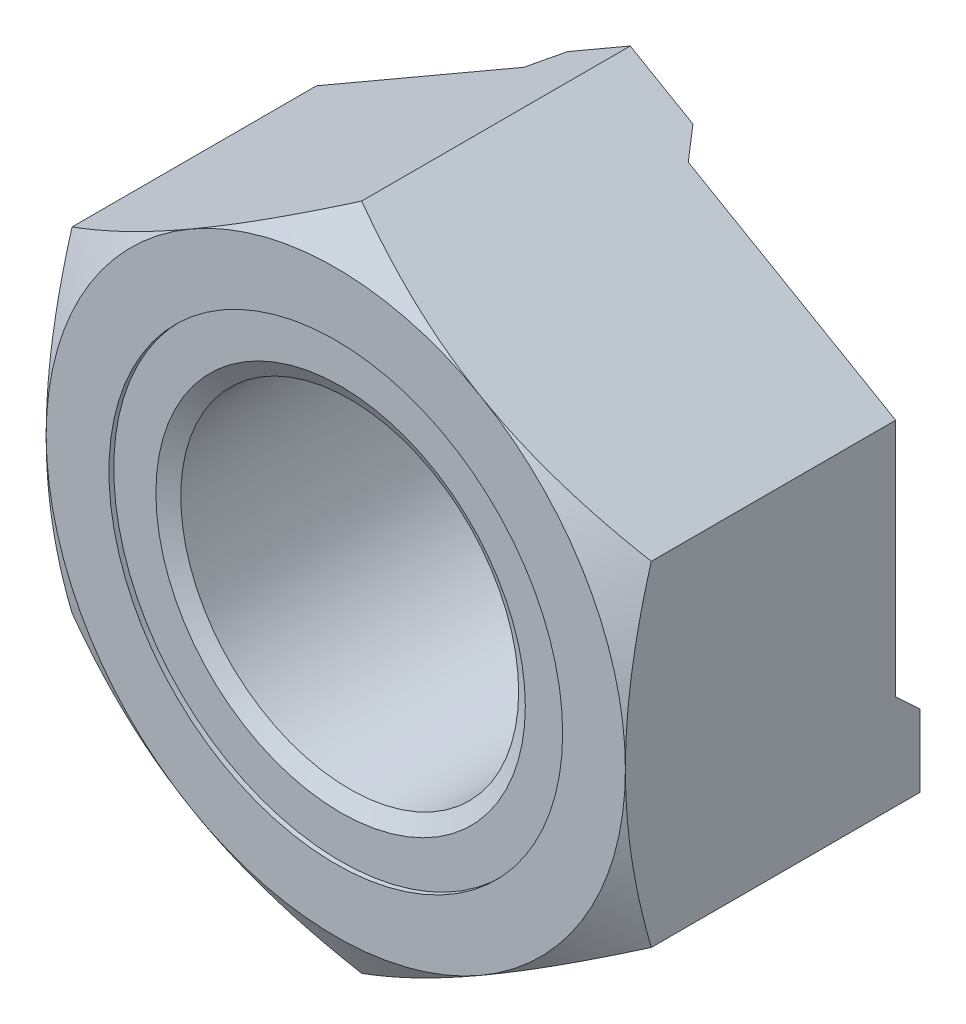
ISO-10303-21;
HEADER;
FILE_DESCRIPTION(('STEP AP214'),'2;1');
FILE_NAME('part.step','',(''),(''),'','','');
FILE_SCHEMA(('AUTOMOTIVE_DESIGN { 1 0 10303 214 1 1 1 1 }'));
ENDSEC;
DATA;
#1=APPLICATION_CONTEXT('core data for automotive mechanical design processes');
#2=APPLICATION_PROTOCOL_DEFINITION('international standard','automotive_design',2000,#1);
#3=PRODUCT_CONTEXT('',#1,'mechanical');
#4=PRODUCT('Part','Part','',(#3));
#5=PRODUCT_RELATED_PRODUCT_CATEGORY('part','',(#4));
#6=PRODUCT_DEFINITION_FORMATION('','',#4);
#7=PRODUCT_DEFINITION_CONTEXT('part definition',#1,'design');
#8=PRODUCT_DEFINITION('design','',#6,#7);
#9=PRODUCT_DEFINITION_SHAPE('','',#8);
#10=(LENGTH_UNIT() NAMED_UNIT(*) SI_UNIT(.MILLI.,.METRE.));
#11=(NAMED_UNIT(*) PLANE_ANGLE_UNIT() SI_UNIT($,.RADIAN.));
#12=(NAMED_UNIT(*) SI_UNIT($,.STERADIAN.) SOLID_ANGLE_UNIT());
#13=UNCERTAINTY_MEASURE_WITH_UNIT(LENGTH_MEASURE(1.E-05),#10,'distance_accuracy_value','');
#14=(GEOMETRIC_REPRESENTATION_CONTEXT(3) GLOBAL_UNCERTAINTY_ASSIGNED_CONTEXT((#13)) GLOBAL_UNIT_ASSIGNED_CONTEXT((#10,
#11,#12)) REPRESENTATION_CONTEXT('',''));
#15=CARTESIAN_POINT('',(0.,0.,0.));
#16=DIRECTION('',(0.,0.,1.));
#17=DIRECTION('',(1.,0.,0.));
#18=AXIS2_PLACEMENT_3D('',#15,#16,#17);
#19=CARTESIAN_POINT('',(0.,0.,-0.635085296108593));
#20=DIRECTION('',(0.,0.,1.));
#21=DIRECTION('',(1.,0.,0.));
#22=AXIS2_PLACEMENT_3D('',#19,#20,#21);
#23=CONICAL_SURFACE('',#22,6.9,1.04719755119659);
#24=CARTESIAN_POINT('',(0.,0.,-0.57735026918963));
#25=DIRECTION('',(0.,0.,1.));
#26=DIRECTION('',(1.,0.,0.));
#27=AXIS2_PLACEMENT_3D('',#24,#25,#26);
#28=CIRCLE('',#27,7.);
#29=CARTESIAN_POINT('',(7.,0.,-0.57735026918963));
#30=VERTEX_POINT('',#29);
#31=EDGE_CURVE('E164',#30,#30,#28,.F.);
#32=ORIENTED_EDGE('',*,*,#31,.T.);
#33=EDGE_LOOP('',(#32));
#34=FACE_BOUND('',#33,.T.);
#35=CARTESIAN_POINT('',(0.,0.,-0.2));
#36=DIRECTION('',(0.,0.,1.));
#37=DIRECTION('',(1.,0.,0.));
#38=AXIS2_PLACEMENT_3D('',#35,#36,#37);
#39=CIRCLE('',#38,7.65358983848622);
#40=CARTESIAN_POINT('',(7.65358983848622,0.,-0.2));
#41=VERTEX_POINT('',#40);
#42=EDGE_CURVE('E39',#41,#41,#39,.T.);
#43=ORIENTED_EDGE('',*,*,#42,.T.);
#44=EDGE_LOOP('',(#43));
#45=FACE_BOUND('',#44,.T.);
#46=ADVANCED_FACE('F35',(#34,#45),#23,.F.);
#47=CARTESIAN_POINT('',(0.,0.,-13.));
#48=DIRECTION('',(0.,0.,1.));
#49=DIRECTION('',(1.,0.,0.));
#50=AXIS2_PLACEMENT_3D('',#47,#48,#49);
#51=CYLINDRICAL_SURFACE('',#50,7.);
#52=CARTESIAN_POINT('',(0.,0.,-12.2743924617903));
#53=DIRECTION('',(0.,0.,-1.));
#54=DIRECTION('',(-1.,0.,0.));
#55=AXIS2_PLACEMENT_3D('',#52,#53,#54);
#56=CIRCLE('',#55,7.);
#57=CARTESIAN_POINT('',(7.,0.,-12.2743924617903));
#58=VERTEX_POINT('',#57);
#59=EDGE_CURVE('E167',#58,#58,#56,.F.);
#60=CARTESIAN_POINT('',(7.,0.,-0.57735026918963));
#61=CARTESIAN_POINT('',(7.,0.,-0.699194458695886));
#62=CARTESIAN_POINT('',(7.,0.,-0.821038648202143));
#63=CARTESIAN_POINT('',(7.,0.,-1.06472702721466));
#64=CARTESIAN_POINT('',(7.,0.,-1.18657121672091));
#65=CARTESIAN_POINT('',(7.,0.,-1.43025959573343));
#66=CARTESIAN_POINT('',(7.,0.,-1.55210378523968));
#67=CARTESIAN_POINT('',(7.,0.,-1.7957921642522));
#68=CARTESIAN_POINT('',(7.,0.,-1.91763635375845));
#69=CARTESIAN_POINT('',(7.,0.,-2.16132473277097));
#70=CARTESIAN_POINT('',(7.,0.,-2.28316892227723));
#71=CARTESIAN_POINT('',(7.,0.,-2.52685730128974));
#72=CARTESIAN_POINT('',(7.,0.,-2.648701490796));
#73=CARTESIAN_POINT('',(7.,0.,-2.89238986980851));
#74=CARTESIAN_POINT('',(7.,0.,-3.01423405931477));
#75=CARTESIAN_POINT('',(7.,0.,-3.25792243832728));
#76=CARTESIAN_POINT('',(7.,0.,-3.37976662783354));
#77=CARTESIAN_POINT('',(7.,0.,-3.62345500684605));
#78=CARTESIAN_POINT('',(7.,0.,-3.74529919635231));
#79=CARTESIAN_POINT('',(7.,0.,-3.98898757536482));
#80=CARTESIAN_POINT('',(7.,0.,-4.11083176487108));
#81=CARTESIAN_POINT('',(7.,0.,-4.35452014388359));
#82=CARTESIAN_POINT('',(7.,0.,-4.47636433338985));
#83=CARTESIAN_POINT('',(7.,0.,-4.72005271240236));
#84=CARTESIAN_POINT('',(7.,0.,-4.84189690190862));
#85=CARTESIAN_POINT('',(7.,0.,-5.08558528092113));
#86=CARTESIAN_POINT('',(7.,0.,-5.20742947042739));
#87=CARTESIAN_POINT('',(7.,0.,-5.4511178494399));
#88=CARTESIAN_POINT('',(7.,0.,-5.57296203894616));
#89=CARTESIAN_POINT('',(7.,0.,-5.81665041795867));
#90=CARTESIAN_POINT('',(7.,0.,-5.93849460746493));
#91=CARTESIAN_POINT('',(7.,0.,-6.18218298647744));
#92=CARTESIAN_POINT('',(7.,0.,-6.3040271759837));
#93=CARTESIAN_POINT('',(7.,0.,-6.54771555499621));
#94=CARTESIAN_POINT('',(7.,0.,-6.66955974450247));
#95=CARTESIAN_POINT('',(7.,0.,-6.91324812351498));
#96=CARTESIAN_POINT('',(7.,0.,-7.03509231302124));
#97=CARTESIAN_POINT('',(7.,0.,-7.27878069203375));
#98=CARTESIAN_POINT('',(7.,0.,-7.40062488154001));
#99=CARTESIAN_POINT('',(7.,0.,-7.64431326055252));
#100=CARTESIAN_POINT('',(7.,0.,-7.76615745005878));
#101=CARTESIAN_POINT('',(7.,0.,-8.0098458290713));
#102=CARTESIAN_POINT('',(7.,0.,-8.13169001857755));
#103=CARTESIAN_POINT('',(7.,0.,-8.37537839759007));
#104=CARTESIAN_POINT('',(7.,0.,-8.49722258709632));
#105=CARTESIAN_POINT('',(7.,0.,-8.74091096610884));
#106=CARTESIAN_POINT('',(7.,0.,-8.86275515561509));
#107=CARTESIAN_POINT('',(7.,0.,-9.10644353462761));
#108=CARTESIAN_POINT('',(7.,0.,-9.22828772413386));
#109=CARTESIAN_POINT('',(7.,0.,-9.47197610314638));
#110=CARTESIAN_POINT('',(7.,0.,-9.59382029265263));
#111=CARTESIAN_POINT('',(7.,0.,-9.83750867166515));
#112=CARTESIAN_POINT('',(7.,0.,-9.9593528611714));
#113=CARTESIAN_POINT('',(7.,0.,-10.2030412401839));
#114=CARTESIAN_POINT('',(7.,0.,-10.3248854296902));
#115=CARTESIAN_POINT('',(7.,0.,-10.5685738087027));
#116=CARTESIAN_POINT('',(7.,0.,-10.6904179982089));
#117=CARTESIAN_POINT('',(7.,0.,-10.9341063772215));
#118=CARTESIAN_POINT('',(7.,0.,-11.0559505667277));
#119=CARTESIAN_POINT('',(7.,0.,-11.2996389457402));
#120=CARTESIAN_POINT('',(7.,0.,-11.4214831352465));
#121=CARTESIAN_POINT('',(7.,0.,-11.665171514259));
#122=CARTESIAN_POINT('',(7.,0.,-11.7870157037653));
#123=CARTESIAN_POINT('',(7.,0.,-12.0307040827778));
#124=CARTESIAN_POINT('',(7.,0.,-12.152548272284));
#125=CARTESIAN_POINT('',(7.,0.,-12.2743924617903));
#126=B_SPLINE_CURVE_WITH_KNOTS('',3,(#60,#61,#62,#63,#64,#65,#66,#67,#68,#69,#70,#71,#72,#73,
#74,#75,#76,#77,#78,#79,#80,#81,#82,#83,#84,#85,#86,#87,#88,#89,#90,#91,#92,#93,#94,#95,#96,#97,
#98,#99,#100,#101,#102,#103,#104,#105,#106,#107,#108,#109,#110,#111,#112,#113,#114,#115,#116,
#117,#118,#119,#120,#121,#122,#123,#124,#125),.UNSPECIFIED.,.F.,.F.,(4,2,2,2,2,2,2,2,2,2,2,2,2,
2,2,2,2,2,2,2,2,2,2,2,2,2,2,2,2,2,2,2,4),(0.,0.36553256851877,0.731065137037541,
1.09659770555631,1.46213027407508,1.82766284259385,2.19319541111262,2.55872797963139,
2.92426054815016,3.28979311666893,3.6553256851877,4.02085825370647,4.38639082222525,
4.75192339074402,5.11745595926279,5.48298852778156,5.84852109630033,6.2140536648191,
6.57958623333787,6.94511880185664,7.31065137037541,7.67618393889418,8.04171650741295,
8.40724907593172,8.77278164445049,9.13831421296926,9.50384678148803,9.8693793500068,
10.2349119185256,10.6004444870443,10.9659770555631,11.3315096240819,11.6970421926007),.UNSPECIFIED.);
#127=EDGE_CURVE('BSEAM243',#30,#58,#126,.T.);
#128=ORIENTED_EDGE('',*,*,#31,.F.);
#129=ORIENTED_EDGE('',*,*,#59,.F.);
#130=ORIENTED_EDGE('',*,*,#127,.T.);
#131=ORIENTED_EDGE('',*,*,#127,.F.);
#132=EDGE_LOOP('',(#128,#130,#129,#131));
#133=FACE_BOUND('',#132,.T.);
#134=ADVANCED_FACE('F243',(#133),#51,.F.);
#135=CARTESIAN_POINT('',(0.,13.856406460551,-13.));
#136=DIRECTION('',(-0.500000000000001,0.866025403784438,0.));
#137=DIRECTION('',(-0.866025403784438,-0.500000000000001,0.));
#138=AXIS2_PLACEMENT_3D('',#135,#136,#137);
#139=PLANE('',#138);
#140=DIRECTION('',(0.,0.,1.));
#141=VECTOR('',#140,1.);
#142=CARTESIAN_POINT('',(0.,13.856406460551,-13.));
#143=LINE('',#142,#141);
#144=CARTESIAN_POINT('',(0.,13.856406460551,-12.2));
#145=VERTEX_POINT('',#144);
#146=CARTESIAN_POINT('',(0.,13.856406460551,-1.0717967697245));
#147=VERTEX_POINT('',#146);
#148=EDGE_CURVE('E506',#145,#147,#143,.T.);
#149=ORIENTED_EDGE('',*,*,#148,.F.);
#150=DIRECTION('',(0.866025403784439,0.5,0.));
#151=VECTOR('',#150,1.);
#152=CARTESIAN_POINT('',(0.,13.856406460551,-12.2));
#153=LINE('',#152,#151);
#154=CARTESIAN_POINT('',(-2.59807621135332,12.356406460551,-12.2));
#155=VERTEX_POINT('',#154);
#156=EDGE_CURVE('E183',#155,#145,#153,.T.);
#157=ORIENTED_EDGE('',*,*,#156,.F.);
#158=DIRECTION('',(0.590661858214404,0.341018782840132,-0.731317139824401));
#159=VECTOR('',#158,1.);
#160=CARTESIAN_POINT('',(-2.21754366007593,12.5761070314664,-12.671149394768));
#161=LINE('',#160,#159);
#162=CARTESIAN_POINT('',(-3.40574476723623,11.890098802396,-11.2));
#163=VERTEX_POINT('',#162);
#164=EDGE_CURVE('E513',#155,#163,#161,.F.);
#165=ORIENTED_EDGE('',*,*,#164,.T.);
#166=DIRECTION('',(-0.866025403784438,-0.500000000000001,0.));
#167=VECTOR('',#166,1.);
#168=CARTESIAN_POINT('',(0.,13.856406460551,-11.2));
#169=LINE('',#168,#167);
#170=CARTESIAN_POINT('',(-12.,6.92820323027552,-11.2));
#171=VERTEX_POINT('',#170);
#172=EDGE_CURVE('E209',#163,#171,#169,.T.);
#173=ORIENTED_EDGE('',*,*,#172,.T.);
#174=DIRECTION('',(0.,0.,1.));
#175=VECTOR('',#174,1.);
#176=CARTESIAN_POINT('',(-12.,6.9282032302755,-13.));
#177=LINE('',#176,#175);
#178=CARTESIAN_POINT('',(-12.,6.9282032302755,-1.07179676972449));
#179=VERTEX_POINT('',#178);
#180=EDGE_CURVE('E153',#171,#179,#177,.T.);
#181=ORIENTED_EDGE('',*,*,#180,.T.);
#182=CARTESIAN_POINT('',(-12.0002,6.92808776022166,-1.07186343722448));
#183=CARTESIAN_POINT('',(-11.7364142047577,7.08038456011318,-0.983949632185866));
#184=CARTESIAN_POINT('',(-11.4716448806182,7.2332492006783,-0.900025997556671));
#185=CARTESIAN_POINT('',(-10.9399829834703,7.54020434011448,-0.741266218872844));
#186=CARTESIAN_POINT('',(-10.6730897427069,7.69429522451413,-0.666433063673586));
#187=CARTESIAN_POINT('',(-9.86810959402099,8.15905073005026,-0.457017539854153));
#188=CARTESIAN_POINT('',(-9.3268449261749,8.47155003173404,-0.337903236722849));
#189=CARTESIAN_POINT('',(-8.51686717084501,8.93919090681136,-0.198231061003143));
#190=CARTESIAN_POINT('',(-8.25057389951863,9.09293539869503,-0.158443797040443));
#191=CARTESIAN_POINT('',(-7.71675440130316,9.4011362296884,-0.0917233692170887));
#192=CARTESIAN_POINT('',(-7.44922815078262,9.55559258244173,-0.0647904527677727));
#193=CARTESIAN_POINT('',(-6.91372963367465,9.86476279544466,-0.0244685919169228));
#194=CARTESIAN_POINT('',(-6.64575827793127,10.0194761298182,-0.0110635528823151));
#195=CARTESIAN_POINT('',(-6.10956726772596,10.3290461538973,0.00191690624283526));
#196=CARTESIAN_POINT('',(-5.84134762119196,10.4839028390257,0.00149275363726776));
#197=CARTESIAN_POINT('',(-5.3399106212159,10.7734076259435,-0.0122200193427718));
#198=CARTESIAN_POINT('',(-5.10665750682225,10.908076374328,-0.0238359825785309));
#199=CARTESIAN_POINT('',(-4.64068775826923,11.1771041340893,-0.0573080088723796));
#200=CARTESIAN_POINT('',(-4.40797116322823,11.3114631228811,-0.0791647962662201));
#201=CARTESIAN_POINT('',(-3.94320092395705,11.5797983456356,-0.132737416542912));
#202=CARTESIAN_POINT('',(-3.711147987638,11.7137741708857,-0.164461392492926));
#203=CARTESIAN_POINT('',(-3.24813003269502,11.9810977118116,-0.237211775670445));
#204=CARTESIAN_POINT('',(-3.01716508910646,12.1144453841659,-0.278238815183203));
#205=CARTESIAN_POINT('',(-2.31605804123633,12.5192297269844,-0.416311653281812));
#206=CARTESIAN_POINT('',(-1.84794625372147,12.789494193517,-0.527124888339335));
#207=CARTESIAN_POINT('',(-0.91870289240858,13.3259930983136,-0.778625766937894));
#208=CARTESIAN_POINT('',(-0.457559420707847,13.5922344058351,-0.919254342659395));
#209=CARTESIAN_POINT('',(0.000199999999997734,13.8565219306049,-1.07186343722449));
#210=B_SPLINE_CURVE_WITH_KNOTS('',3,(#182,#183,#184,#185,#186,#187,#188,#189,#190,#191,#192,
#193,#194,#195,#196,#197,#198,#199,#200,#201,#202,#203,#204,#205,#206,#207,#208,#209),
.UNSPECIFIED.,.F.,.F.,(4,2,2,2,2,2,2,2,2,2,2,2,2,4),(0.,0.951004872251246,1.90232158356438,
3.80900466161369,4.73894551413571,5.6689042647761,6.59775529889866,7.52657763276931,
8.33514643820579,9.1437724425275,9.95306755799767,10.7624176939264,12.4167102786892,
14.0677556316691),.UNSPECIFIED.);
#211=CARTESIAN_POINT('',(-6.00000000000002,10.3923048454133,0.));
#212=VERTEX_POINT('',#211);
#213=EDGE_CURVE('E265',#179,#212,#210,.T.);
#214=ORIENTED_EDGE('',*,*,#213,.T.);
#215=EDGE_CURVE('E272',#212,#147,#210,.T.);
#216=ORIENTED_EDGE('',*,*,#215,.T.);
#217=EDGE_LOOP('',(#149,#157,#165,#173,#181,#214,#216));
#218=FACE_BOUND('',#217,.T.);
#219=ADVANCED_FACE('F280',(#218),#139,.T.);
#220=CARTESIAN_POINT('',(12.,6.9282032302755,-13.));
#221=DIRECTION('',(0.500000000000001,0.866025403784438,0.));
#222=DIRECTION('',(-0.866025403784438,0.500000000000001,0.));
#223=AXIS2_PLACEMENT_3D('',#220,#221,#222);
#224=PLANE('',#223);
#225=DIRECTION('',(0.,0.,1.));
#226=VECTOR('',#225,1.);
#227=CARTESIAN_POINT('',(12.,6.9282032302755,-13.));
#228=LINE('',#227,#226);
#229=CARTESIAN_POINT('',(12.,6.92820323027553,-11.2));
#230=VERTEX_POINT('',#229);
#231=CARTESIAN_POINT('',(12.,6.92820323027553,-1.0717967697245));
#232=VERTEX_POINT('',#231);
#233=EDGE_CURVE('E556',#230,#232,#228,.T.);
#234=ORIENTED_EDGE('',*,*,#233,.F.);
#235=DIRECTION('',(-0.866025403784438,0.500000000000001,0.));
#236=VECTOR('',#235,1.);
#237=CARTESIAN_POINT('',(12.,6.9282032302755,-11.2));
#238=LINE('',#237,#236);
#239=CARTESIAN_POINT('',(3.40574476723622,11.890098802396,-11.2));
#240=VERTEX_POINT('',#239);
#241=EDGE_CURVE('E206',#230,#240,#238,.T.);
#242=ORIENTED_EDGE('',*,*,#241,.T.);
#243=DIRECTION('',(0.590661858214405,-0.341018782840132,0.731317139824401));
#244=VECTOR('',#243,1.);
#245=CARTESIAN_POINT('',(2.21754366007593,12.5761070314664,-12.671149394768));
#246=LINE('',#245,#244);
#247=CARTESIAN_POINT('',(2.59807621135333,12.356406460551,-12.2));
#248=VERTEX_POINT('',#247);
#249=EDGE_CURVE('E511',#240,#248,#246,.F.);
#250=ORIENTED_EDGE('',*,*,#249,.T.);
#251=DIRECTION('',(0.86602540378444,-0.499999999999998,0.));
#252=VECTOR('',#251,1.);
#253=CARTESIAN_POINT('',(0.,13.856406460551,-12.2));
#254=LINE('',#253,#252);
#255=EDGE_CURVE('E186',#145,#248,#254,.T.);
#256=ORIENTED_EDGE('',*,*,#255,.F.);
#257=ORIENTED_EDGE('',*,*,#148,.T.);
#258=CARTESIAN_POINT('',(-0.000200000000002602,13.8565219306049,-1.07186343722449));
#259=CARTESIAN_POINT('',(0.26358579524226,13.7042251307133,-0.983949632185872));
#260=CARTESIAN_POINT('',(0.528355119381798,13.5513604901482,-0.900025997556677));
#261=CARTESIAN_POINT('',(1.06001701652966,13.244405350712,-0.741266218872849));
#262=CARTESIAN_POINT('',(1.32691025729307,13.0903144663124,-0.66643306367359));
#263=CARTESIAN_POINT('',(2.13189040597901,12.6255589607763,-0.457017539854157));
#264=CARTESIAN_POINT('',(2.6731550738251,12.3130596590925,-0.337903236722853));
#265=CARTESIAN_POINT('',(3.483132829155,11.8454187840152,-0.198231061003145));
#266=CARTESIAN_POINT('',(3.74942610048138,11.6916742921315,-0.158443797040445));
#267=CARTESIAN_POINT('',(4.28324559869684,11.3834734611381,-0.0917233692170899));
#268=CARTESIAN_POINT('',(4.55077184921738,11.2290171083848,-0.0647904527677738));
#269=CARTESIAN_POINT('',(5.08627036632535,10.9198468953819,-0.0244685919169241));
#270=CARTESIAN_POINT('',(5.35424172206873,10.7651335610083,-0.0110635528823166));
#271=CARTESIAN_POINT('',(5.89043273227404,10.4555635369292,0.00191690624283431));
#272=CARTESIAN_POINT('',(6.15865237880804,10.3007068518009,0.00149275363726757));
#273=CARTESIAN_POINT('',(6.66008937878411,10.011202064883,-0.0122200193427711));
#274=CARTESIAN_POINT('',(6.89334249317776,9.87653331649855,-0.02383598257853));
#275=CARTESIAN_POINT('',(7.35931224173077,9.60750555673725,-0.0573080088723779));
#276=CARTESIAN_POINT('',(7.59202883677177,9.47314656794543,-0.0791647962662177));
#277=CARTESIAN_POINT('',(8.05679907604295,9.20481134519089,-0.13273741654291));
#278=CARTESIAN_POINT('',(8.28885201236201,9.07083551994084,-0.164461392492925));
#279=CARTESIAN_POINT('',(8.75186996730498,8.80351197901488,-0.237211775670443));
#280=CARTESIAN_POINT('',(8.98283491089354,8.67016430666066,-0.2782388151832));
#281=CARTESIAN_POINT('',(9.68394195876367,8.2653799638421,-0.416311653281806));
#282=CARTESIAN_POINT('',(10.1520537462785,7.99511549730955,-0.52712488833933));
#283=CARTESIAN_POINT('',(11.0812971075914,7.45861659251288,-0.77862576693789));
#284=CARTESIAN_POINT('',(11.5424405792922,7.19237528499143,-0.919254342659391));
#285=CARTESIAN_POINT('',(12.0002,6.92808776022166,-1.07186343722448));
#286=B_SPLINE_CURVE_WITH_KNOTS('',3,(#258,#259,#260,#261,#262,#263,#264,#265,#266,#267,#268,
#269,#270,#271,#272,#273,#274,#275,#276,#277,#278,#279,#280,#281,#282,#283,#284,#285),
.UNSPECIFIED.,.F.,.F.,(4,2,2,2,2,2,2,2,2,2,2,2,2,4),(0.,0.951004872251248,1.90232158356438,
3.80900466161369,4.73894551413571,5.6689042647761,6.59775529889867,7.52657763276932,
8.3351464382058,9.1437724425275,9.95306755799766,10.7624176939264,12.4167102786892,
14.0677556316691),.UNSPECIFIED.);
#287=CARTESIAN_POINT('',(6.00000000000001,10.3923048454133,0.));
#288=VERTEX_POINT('',#287);
#289=EDGE_CURVE('E497',#147,#288,#286,.T.);
#290=ORIENTED_EDGE('',*,*,#289,.T.);
#291=EDGE_CURVE('E273',#288,#232,#286,.T.);
#292=ORIENTED_EDGE('',*,*,#291,.T.);
#293=EDGE_LOOP('',(#234,#242,#250,#256,#257,#290,#292));
#294=FACE_BOUND('',#293,.T.);
#295=ADVANCED_FACE('F284',(#294),#224,.T.);
#296=CARTESIAN_POINT('',(12.,6.9282032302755,-13.));
#297=DIRECTION('',(-1.,0.,0.));
#298=DIRECTION('',(0.,0.,1.));
#299=AXIS2_PLACEMENT_3D('',#296,#297,#298);
#300=PLANE('',#299);
#301=DIRECTION('',(0.,-1.,0.));
#302=VECTOR('',#301,1.);
#303=CARTESIAN_POINT('',(12.,6.9282032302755,-11.2));
#304=LINE('',#303,#302);
#305=CARTESIAN_POINT('',(12.,-2.99558791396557,-11.2));
#306=VERTEX_POINT('',#305);
#307=EDGE_CURVE('E203',#230,#306,#304,.T.);
#308=ORIENTED_EDGE('',*,*,#307,.F.);
#309=ORIENTED_EDGE('',*,*,#233,.T.);
#310=CARTESIAN_POINT('',(12.,-18.3746159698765,-5.74232046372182));
#311=CARTESIAN_POINT('',(12.,-18.1111918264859,-5.61498513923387));
#312=CARTESIAN_POINT('',(12.,-17.8474492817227,-5.48830883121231));
#313=CARTESIAN_POINT('',(12.,-17.3192601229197,-5.23642551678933));
#314=CARTESIAN_POINT('',(12.,-17.0548135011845,-5.11121852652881));
#315=CARTESIAN_POINT('',(12.,-16.2602391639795,-4.73799215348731));
#316=CARTESIAN_POINT('',(12.,-15.7289626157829,-4.49240888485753));
#317=CARTESIAN_POINT('',(12.,-14.659698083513,-4.00791887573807));
#318=CARTESIAN_POINT('',(12.,-14.1216890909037,-3.76905838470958));
#319=CARTESIAN_POINT('',(12.,-13.0412497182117,-3.30159295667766));
#320=CARTESIAN_POINT('',(12.,-12.4988195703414,-3.07298748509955));
#321=CARTESIAN_POINT('',(12.,-11.4019415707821,-2.62605165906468));
#322=CARTESIAN_POINT('',(12.,-10.8474279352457,-2.407881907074));
#323=CARTESIAN_POINT('',(12.,-9.73185625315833,-1.98862863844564));
#324=CARTESIAN_POINT('',(12.,-9.17079748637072,-1.78754702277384));
#325=CARTESIAN_POINT('',(12.,-8.04241377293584,-1.40787575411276));
#326=CARTESIAN_POINT('',(12.,-7.47510504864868,-1.22923828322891));
#327=CARTESIAN_POINT('',(12.,-6.3323679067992,-0.900248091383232));
#328=CARTESIAN_POINT('',(12.,-5.75694211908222,-0.749886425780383));
#329=CARTESIAN_POINT('',(12.,-4.88760620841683,-0.551055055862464));
#330=CARTESIAN_POINT('',(12.,-4.59673300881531,-0.489219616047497));
#331=CARTESIAN_POINT('',(12.,-4.01305048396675,-0.375428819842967));
#332=CARTESIAN_POINT('',(12.,-3.7202412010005,-0.323473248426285));
#333=CARTESIAN_POINT('',(12.,-3.13287727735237,-0.230362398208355));
#334=CARTESIAN_POINT('',(12.,-2.83832249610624,-0.189208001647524));
#335=CARTESIAN_POINT('',(12.,-2.24782315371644,-0.118528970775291));
#336=CARTESIAN_POINT('',(12.,-1.95187864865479,-0.0890038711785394));
#337=CARTESIAN_POINT('',(12.,-1.36089234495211,-0.0423753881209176));
#338=CARTESIAN_POINT('',(12.,-1.06585670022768,-0.0251945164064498));
#339=CARTESIAN_POINT('',(12.,-0.475323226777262,-0.00334573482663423));
#340=CARTESIAN_POINT('',(12.,-0.179825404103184,0.00132233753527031));
#341=CARTESIAN_POINT('',(12.,0.411018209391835,-0.00196522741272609));
#342=CARTESIAN_POINT('',(12.,0.706364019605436,-0.00991732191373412));
#343=CARTESIAN_POINT('',(12.,1.2964630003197,-0.0382476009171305));
#344=CARTESIAN_POINT('',(12.,1.59121614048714,-0.0586264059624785));
#345=CARTESIAN_POINT('',(12.,2.30560702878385,-0.122652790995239));
#346=CARTESIAN_POINT('',(12.,2.72469590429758,-0.172526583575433));
#347=CARTESIAN_POINT('',(12.,3.5596621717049,-0.294627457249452));
#348=CARTESIAN_POINT('',(12.,3.97553865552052,-0.366860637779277));
#349=CARTESIAN_POINT('',(12.,4.80373712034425,-0.531118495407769));
#350=CARTESIAN_POINT('',(12.,5.21605535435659,-0.623161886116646));
#351=CARTESIAN_POINT('',(12.,6.03644960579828,-0.824231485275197));
#352=CARTESIAN_POINT('',(12.,6.44452601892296,-0.933256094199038));
#353=CARTESIAN_POINT('',(12.,7.26648771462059,-1.16853096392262));
#354=CARTESIAN_POINT('',(12.,7.68027019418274,-1.29513795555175));
#355=CARTESIAN_POINT('',(12.,8.50346065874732,-1.5608576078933));
#356=CARTESIAN_POINT('',(12.,8.91287144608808,-1.69996164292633));
#357=CARTESIAN_POINT('',(12.,9.725679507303,-1.98781971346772));
#358=CARTESIAN_POINT('',(12.,10.1290976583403,-2.1365150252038));
#359=CARTESIAN_POINT('',(12.,10.7318330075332,-2.36605061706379));
#360=CARTESIAN_POINT('',(12.,10.9323890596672,-2.44366199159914));
#361=CARTESIAN_POINT('',(12.,11.3327210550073,-2.60085858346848));
#362=CARTESIAN_POINT('',(12.,11.5324970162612,-2.68044375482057));
#363=CARTESIAN_POINT('',(12.,11.7319109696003,-2.76092701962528));
#364=B_SPLINE_CURVE_WITH_KNOTS('',3,(#310,#311,#312,#313,#314,#315,#316,#317,#318,#319,#320,
#321,#322,#323,#324,#325,#326,#327,#328,#329,#330,#331,#332,#333,#334,#335,#336,#337,#338,#339,
#340,#341,#342,#343,#344,#345,#346,#347,#348,#349,#350,#351,#352,#353,#354,#355,#356,#357,#358,
#359,#360,#361,#362,#363),.UNSPECIFIED.,.F.,.F.,(4,2,2,2,2,2,2,2,2,2,2,2,2,2,2,2,2,2,2,2,2,2,2,
2,2,2,4),(0.,0.87775627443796,1.75552218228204,3.51133949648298,5.27720464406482,
7.04297763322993,8.83042883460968,10.6180786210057,12.4018527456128,14.1850616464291,
15.0770405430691,15.9690000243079,16.861032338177,17.7530289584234,18.63937614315,
19.5257118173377,20.4117987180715,21.2979298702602,22.5633628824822,23.8291413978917,
25.0961209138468,26.3629811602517,27.6608948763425,28.9579195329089,30.2476436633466,
30.8927835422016,31.5379084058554),.UNSPECIFIED.);
#365=CARTESIAN_POINT('',(12.,0.,0.));
#366=VERTEX_POINT('',#365);
#367=EDGE_CURVE('E271',#366,#232,#364,.T.);
#368=ORIENTED_EDGE('',*,*,#367,.F.);
#369=CARTESIAN_POINT('',(12.,-6.92820323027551,-1.0717967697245));
#370=VERTEX_POINT('',#369);
#371=EDGE_CURVE('E258',#370,#366,#364,.T.);
#372=ORIENTED_EDGE('',*,*,#371,.F.);
#373=DIRECTION('',(0.,0.,1.));
#374=VECTOR('',#373,1.);
#375=CARTESIAN_POINT('',(12.,-6.92820323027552,-13.));
#376=LINE('',#375,#374);
#377=CARTESIAN_POINT('',(12.,-6.92820323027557,-12.2));
#378=VERTEX_POINT('',#377);
#379=EDGE_CURVE('E538',#378,#370,#376,.T.);
#380=ORIENTED_EDGE('',*,*,#379,.F.);
#381=DIRECTION('',(0.,-1.,0.));
#382=VECTOR('',#381,1.);
#383=CARTESIAN_POINT('',(12.,-6.92820323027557,-12.2));
#384=LINE('',#383,#382);
#385=CARTESIAN_POINT('',(12.,-3.92820323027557,-12.2));
#386=VERTEX_POINT('',#385);
#387=EDGE_CURVE('E174',#386,#378,#384,.T.);
#388=ORIENTED_EDGE('',*,*,#387,.F.);
#389=DIRECTION('',(0.,-0.68203756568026,-0.731317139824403));
#390=VECTOR('',#389,1.);
#391=CARTESIAN_POINT('',(12.,0.722899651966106,-7.2128388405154));
#392=LINE('',#391,#390);
#393=EDGE_CURVE('E520',#386,#306,#392,.F.);
#394=ORIENTED_EDGE('',*,*,#393,.T.);
#395=EDGE_LOOP('',(#308,#309,#368,#372,#380,#388,#394));
#396=FACE_BOUND('',#395,.T.);
#397=ADVANCED_FACE('F342',(#396),#300,.F.);
#398=CARTESIAN_POINT('',(0.,-13.856406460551,-13.));
#399=DIRECTION('',(0.500000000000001,-0.866025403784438,0.));
#400=DIRECTION('',(0.866025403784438,0.500000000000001,0.));
#401=AXIS2_PLACEMENT_3D('',#398,#399,#400);
#402=PLANE('',#401);
#403=DIRECTION('',(0.,0.,1.));
#404=VECTOR('',#403,1.);
#405=CARTESIAN_POINT('',(0.,-13.856406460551,-13.));
#406=LINE('',#405,#404);
#407=CARTESIAN_POINT('',(0.,-13.856406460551,-11.2));
#408=VERTEX_POINT('',#407);
#409=CARTESIAN_POINT('',(0.,-13.856406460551,-1.0717967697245));
#410=VERTEX_POINT('',#409);
#411=EDGE_CURVE('E152',#408,#410,#406,.T.);
#412=ORIENTED_EDGE('',*,*,#411,.F.);
#413=DIRECTION('',(0.866025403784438,0.500000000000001,0.));
#414=VECTOR('',#413,1.);
#415=CARTESIAN_POINT('',(0.,-13.856406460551,-11.2));
#416=LINE('',#415,#414);
#417=CARTESIAN_POINT('',(8.59425523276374,-8.89451088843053,-11.2));
#418=VERTEX_POINT('',#417);
#419=EDGE_CURVE('E200',#408,#418,#416,.T.);
#420=ORIENTED_EDGE('',*,*,#419,.T.);
#421=DIRECTION('',(-0.590661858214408,-0.341018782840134,0.731317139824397));
#422=VECTOR('',#421,1.);
#423=CARTESIAN_POINT('',(9.78245633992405,-8.20850265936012,-12.671149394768));
#424=LINE('',#423,#422);
#425=CARTESIAN_POINT('',(9.40192378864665,-8.42820323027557,-12.2));
#426=VERTEX_POINT('',#425);
#427=EDGE_CURVE('E518',#418,#426,#424,.F.);
#428=ORIENTED_EDGE('',*,*,#427,.T.);
#429=DIRECTION('',(-0.86602540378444,-0.499999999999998,0.));
#430=VECTOR('',#429,1.);
#431=CARTESIAN_POINT('',(12.,-6.92820323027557,-12.2));
#432=LINE('',#431,#430);
#433=EDGE_CURVE('E177',#378,#426,#432,.T.);
#434=ORIENTED_EDGE('',*,*,#433,.F.);
#435=ORIENTED_EDGE('',*,*,#379,.T.);
#436=CARTESIAN_POINT('',(12.0002,-6.92808776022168,-1.07186343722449));
#437=CARTESIAN_POINT('',(11.7364142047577,-7.0803845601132,-0.983949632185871));
#438=CARTESIAN_POINT('',(11.4716448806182,-7.23324920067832,-0.900025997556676));
#439=CARTESIAN_POINT('',(10.9399829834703,-7.54020434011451,-0.741266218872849));
#440=CARTESIAN_POINT('',(10.6730897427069,-7.69429522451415,-0.666433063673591));
#441=CARTESIAN_POINT('',(9.86810959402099,-8.15905073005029,-0.457017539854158));
#442=CARTESIAN_POINT('',(9.32684492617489,-8.47155003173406,-0.337903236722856));
#443=CARTESIAN_POINT('',(8.516867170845,-8.93919090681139,-0.198231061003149));
#444=CARTESIAN_POINT('',(8.25057389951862,-9.09293539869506,-0.158443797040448));
#445=CARTESIAN_POINT('',(7.71675440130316,-9.40113622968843,-0.0917233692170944));
#446=CARTESIAN_POINT('',(7.44922815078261,-9.55559258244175,-0.0647904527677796));
#447=CARTESIAN_POINT('',(6.91372963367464,-9.86476279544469,-0.0244685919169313));
#448=CARTESIAN_POINT('',(6.64575827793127,-10.0194761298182,-0.0110635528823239));
#449=CARTESIAN_POINT('',(6.10956726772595,-10.3290461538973,0.00191690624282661));
#450=CARTESIAN_POINT('',(5.84134762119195,-10.4839028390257,0.00149275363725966));
#451=CARTESIAN_POINT('',(5.33991062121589,-10.7734076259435,-0.0122200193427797));
#452=CARTESIAN_POINT('',(5.10665750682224,-10.908076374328,-0.0238359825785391));
#453=CARTESIAN_POINT('',(4.64068775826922,-11.1771041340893,-0.0573080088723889));
#454=CARTESIAN_POINT('',(4.40797116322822,-11.3114631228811,-0.0791647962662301));
#455=CARTESIAN_POINT('',(3.94320092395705,-11.5797983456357,-0.132737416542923));
#456=CARTESIAN_POINT('',(3.71114798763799,-11.7137741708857,-0.164461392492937));
#457=CARTESIAN_POINT('',(3.24813003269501,-11.9810977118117,-0.237211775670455));
#458=CARTESIAN_POINT('',(3.01716508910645,-12.1144453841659,-0.278238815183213));
#459=CARTESIAN_POINT('',(2.31605804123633,-12.5192297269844,-0.416311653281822));
#460=CARTESIAN_POINT('',(1.84794625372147,-12.789494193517,-0.527124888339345));
#461=CARTESIAN_POINT('',(0.918702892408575,-13.3259930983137,-0.778625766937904));
#462=CARTESIAN_POINT('',(0.457559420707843,-13.5922344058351,-0.919254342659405));
#463=CARTESIAN_POINT('',(-0.000199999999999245,-13.8565219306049,-1.0718634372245));
#464=B_SPLINE_CURVE_WITH_KNOTS('',3,(#436,#437,#438,#439,#440,#441,#442,#443,#444,#445,#446,
#447,#448,#449,#450,#451,#452,#453,#454,#455,#456,#457,#458,#459,#460,#461,#462,#463),
.UNSPECIFIED.,.F.,.F.,(4,2,2,2,2,2,2,2,2,2,2,2,2,4),(0.,0.951004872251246,1.90232158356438,
3.80900466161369,4.73894551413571,5.6689042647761,6.59775529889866,7.52657763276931,
8.3351464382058,9.1437724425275,9.95306755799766,10.7624176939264,12.4167102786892,
14.0677556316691),.UNSPECIFIED.);
#465=CARTESIAN_POINT('',(6.00000000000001,-10.3923048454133,0.));
#466=VERTEX_POINT('',#465);
#467=EDGE_CURVE('E485',#370,#466,#464,.T.);
#468=ORIENTED_EDGE('',*,*,#467,.T.);
#469=EDGE_CURVE('E251',#466,#410,#464,.T.);
#470=ORIENTED_EDGE('',*,*,#469,.T.);
#471=EDGE_LOOP('',(#412,#420,#428,#434,#435,#468,#470));
#472=FACE_BOUND('',#471,.T.);
#473=ADVANCED_FACE('F346',(#472),#402,.T.);
#474=CARTESIAN_POINT('',(-12.,-6.92820323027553,-13.));
#475=DIRECTION('',(-0.5,-0.866025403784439,0.));
#476=DIRECTION('',(0.866025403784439,-0.5,0.));
#477=AXIS2_PLACEMENT_3D('',#474,#475,#476);
#478=PLANE('',#477);
#479=DIRECTION('',(0.,0.,1.));
#480=VECTOR('',#479,1.);
#481=CARTESIAN_POINT('',(-12.,-6.92820323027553,-13.));
#482=LINE('',#481,#480);
#483=CARTESIAN_POINT('',(-12.0000000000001,-6.9282032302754,-12.2));
#484=VERTEX_POINT('',#483);
#485=CARTESIAN_POINT('',(-12.,-6.92820323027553,-1.0717967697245));
#486=VERTEX_POINT('',#485);
#487=EDGE_CURVE('E140',#484,#486,#482,.T.);
#488=ORIENTED_EDGE('',*,*,#487,.F.);
#489=DIRECTION('',(-0.866025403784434,0.500000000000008,0.));
#490=VECTOR('',#489,1.);
#491=CARTESIAN_POINT('',(-12.0000000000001,-6.9282032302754,-12.2));
#492=LINE('',#491,#490);
#493=CARTESIAN_POINT('',(-9.40192378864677,-8.42820323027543,-12.2));
#494=VERTEX_POINT('',#493);
#495=EDGE_CURVE('E144',#494,#484,#492,.T.);
#496=ORIENTED_EDGE('',*,*,#495,.F.);
#497=DIRECTION('',(-0.590661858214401,0.341018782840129,-0.731317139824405));
#498=VECTOR('',#497,1.);
#499=CARTESIAN_POINT('',(-9.78245633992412,-8.20850265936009,-12.671149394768));
#500=LINE('',#499,#498);
#501=CARTESIAN_POINT('',(-8.59425523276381,-8.8945108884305,-11.2));
#502=VERTEX_POINT('',#501);
#503=EDGE_CURVE('E11',#494,#502,#500,.F.);
#504=ORIENTED_EDGE('',*,*,#503,.T.);
#505=DIRECTION('',(0.866025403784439,-0.5,0.));
#506=VECTOR('',#505,1.);
#507=CARTESIAN_POINT('',(-12.,-6.92820323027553,-11.2));
#508=LINE('',#507,#506);
#509=EDGE_CURVE('E196',#502,#408,#508,.T.);
#510=ORIENTED_EDGE('',*,*,#509,.T.);
#511=ORIENTED_EDGE('',*,*,#411,.T.);
#512=CARTESIAN_POINT('',(0.000200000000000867,-13.8565219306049,-1.0718634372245));
#513=CARTESIAN_POINT('',(-0.263585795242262,-13.7042251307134,-0.98394963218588));
#514=CARTESIAN_POINT('',(-0.528355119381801,-13.5513604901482,-0.900025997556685));
#515=CARTESIAN_POINT('',(-1.06001701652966,-13.2444053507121,-0.741266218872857));
#516=CARTESIAN_POINT('',(-1.32691025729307,-13.0903144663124,-0.666433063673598));
#517=CARTESIAN_POINT('',(-2.13189040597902,-12.6255589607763,-0.457017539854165));
#518=CARTESIAN_POINT('',(-2.67315507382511,-12.3130596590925,-0.337903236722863));
#519=CARTESIAN_POINT('',(-3.48313282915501,-11.8454187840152,-0.198231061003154));
#520=CARTESIAN_POINT('',(-3.74942610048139,-11.6916742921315,-0.158443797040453));
#521=CARTESIAN_POINT('',(-4.28324559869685,-11.3834734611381,-0.0917233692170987));
#522=CARTESIAN_POINT('',(-4.55077184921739,-11.2290171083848,-0.0647904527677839));
#523=CARTESIAN_POINT('',(-5.08627036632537,-10.9198468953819,-0.0244685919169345));
#524=CARTESIAN_POINT('',(-5.35424172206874,-10.7651335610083,-0.0110635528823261));
#525=CARTESIAN_POINT('',(-5.89043273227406,-10.4555635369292,0.00191690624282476));
#526=CARTESIAN_POINT('',(-6.15865237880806,-10.3007068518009,0.00149275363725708));
#527=CARTESIAN_POINT('',(-6.66008937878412,-10.0112020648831,-0.0122200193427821));
#528=CARTESIAN_POINT('',(-6.89334249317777,-9.87653331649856,-0.0238359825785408));
#529=CARTESIAN_POINT('',(-7.35931224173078,-9.60750555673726,-0.0573080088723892));
#530=CARTESIAN_POINT('',(-7.59202883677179,-9.47314656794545,-0.0791647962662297));
#531=CARTESIAN_POINT('',(-8.05679907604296,-9.20481134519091,-0.132737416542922));
#532=CARTESIAN_POINT('',(-8.28885201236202,-9.07083551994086,-0.164461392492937));
#533=CARTESIAN_POINT('',(-8.75186996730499,-8.8035119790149,-0.237211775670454));
#534=CARTESIAN_POINT('',(-8.98283491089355,-8.67016430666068,-0.278238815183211));
#535=CARTESIAN_POINT('',(-9.68394195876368,-8.26537996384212,-0.416311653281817));
#536=CARTESIAN_POINT('',(-10.1520537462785,-7.99511549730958,-0.527124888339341));
#537=CARTESIAN_POINT('',(-11.0812971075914,-7.45861659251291,-0.7786257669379));
#538=CARTESIAN_POINT('',(-11.5424405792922,-7.19237528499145,-0.9192543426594));
#539=CARTESIAN_POINT('',(-12.0002,-6.92808776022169,-1.07186343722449));
#540=B_SPLINE_CURVE_WITH_KNOTS('',3,(#512,#513,#514,#515,#516,#517,#518,#519,#520,#521,#522,
#523,#524,#525,#526,#527,#528,#529,#530,#531,#532,#533,#534,#535,#536,#537,#538,#539),
.UNSPECIFIED.,.F.,.F.,(4,2,2,2,2,2,2,2,2,2,2,2,2,4),(0.,0.951004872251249,1.90232158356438,
3.8090046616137,4.73894551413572,5.66890426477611,6.59775529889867,7.52657763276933,
8.33514643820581,9.14377244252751,9.95306755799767,10.7624176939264,12.4167102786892,
14.0677556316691),.UNSPECIFIED.);
#541=CARTESIAN_POINT('',(-6.,-10.3923048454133,0.));
#542=VERTEX_POINT('',#541);
#543=EDGE_CURVE('E482',#410,#542,#540,.T.);
#544=ORIENTED_EDGE('',*,*,#543,.T.);
#545=EDGE_CURVE('E148',#542,#486,#540,.T.);
#546=ORIENTED_EDGE('',*,*,#545,.T.);
#547=EDGE_LOOP('',(#488,#496,#504,#510,#511,#544,#546));
#548=FACE_BOUND('',#547,.T.);
#549=ADVANCED_FACE('F142',(#548),#478,.T.);
#550=CARTESIAN_POINT('',(-12.,6.9282032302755,-13.));
#551=DIRECTION('',(-1.,0.,0.));
#552=DIRECTION('',(0.,0.,1.));
#553=AXIS2_PLACEMENT_3D('',#550,#551,#552);
#554=PLANE('',#553);
#555=ORIENTED_EDGE('',*,*,#180,.F.);
#556=DIRECTION('',(0.,-1.,0.));
#557=VECTOR('',#556,1.);
#558=CARTESIAN_POINT('',(-12.,6.9282032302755,-11.2));
#559=LINE('',#558,#557);
#560=CARTESIAN_POINT('',(-12.,-2.99558791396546,-11.2));
#561=VERTEX_POINT('',#560);
#562=EDGE_CURVE('E480',#171,#561,#559,.T.);
#563=ORIENTED_EDGE('',*,*,#562,.T.);
#564=DIRECTION('',(0.,0.68203756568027,0.731317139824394));
#565=VECTOR('',#564,1.);
#566=CARTESIAN_POINT('',(-12.,-4.36760437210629,-12.671149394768));
#567=LINE('',#566,#565);
#568=CARTESIAN_POINT('',(-12.,-3.92820323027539,-12.2));
#569=VERTEX_POINT('',#568);
#570=EDGE_CURVE('E44',#561,#569,#567,.F.);
#571=ORIENTED_EDGE('',*,*,#570,.T.);
#572=DIRECTION('',(0.,1.,0.));
#573=VECTOR('',#572,1.);
#574=CARTESIAN_POINT('',(-12.0000000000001,-6.9282032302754,-12.2));
#575=LINE('',#574,#573);
#576=EDGE_CURVE('E156',#484,#569,#575,.T.);
#577=ORIENTED_EDGE('',*,*,#576,.F.);
#578=ORIENTED_EDGE('',*,*,#487,.T.);
#579=CARTESIAN_POINT('',(-12.,-18.3746159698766,-5.74232046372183));
#580=CARTESIAN_POINT('',(-12.,-18.1111918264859,-5.61498513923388));
#581=CARTESIAN_POINT('',(-12.,-17.8474492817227,-5.48830883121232));
#582=CARTESIAN_POINT('',(-12.,-17.3192601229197,-5.23642551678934));
#583=CARTESIAN_POINT('',(-12.,-17.0548135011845,-5.11121852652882));
#584=CARTESIAN_POINT('',(-12.,-16.2602391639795,-4.73799215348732));
#585=CARTESIAN_POINT('',(-12.,-15.7289626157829,-4.49240888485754));
#586=CARTESIAN_POINT('',(-12.,-14.659698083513,-4.00791887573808));
#587=CARTESIAN_POINT('',(-12.,-14.1216890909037,-3.76905838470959));
#588=CARTESIAN_POINT('',(-12.,-13.0412497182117,-3.30159295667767));
#589=CARTESIAN_POINT('',(-12.,-12.4988195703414,-3.07298748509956));
#590=CARTESIAN_POINT('',(-12.,-11.4019415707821,-2.62605165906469));
#591=CARTESIAN_POINT('',(-12.,-10.8474279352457,-2.40788190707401));
#592=CARTESIAN_POINT('',(-12.,-9.73185625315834,-1.98862863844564));
#593=CARTESIAN_POINT('',(-12.,-9.17079748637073,-1.78754702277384));
#594=CARTESIAN_POINT('',(-12.,-8.04241377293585,-1.40787575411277));
#595=CARTESIAN_POINT('',(-12.,-7.47510504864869,-1.22923828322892));
#596=CARTESIAN_POINT('',(-12.,-6.33236790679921,-0.900248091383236));
#597=CARTESIAN_POINT('',(-12.,-5.75694211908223,-0.749886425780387));
#598=CARTESIAN_POINT('',(-12.,-4.88760620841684,-0.551055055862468));
#599=CARTESIAN_POINT('',(-12.,-4.59673300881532,-0.489219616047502));
#600=CARTESIAN_POINT('',(-12.,-4.01305048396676,-0.375428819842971));
#601=CARTESIAN_POINT('',(-12.,-3.7202412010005,-0.323473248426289));
#602=CARTESIAN_POINT('',(-12.,-3.13287727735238,-0.230362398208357));
#603=CARTESIAN_POINT('',(-12.,-2.83832249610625,-0.189208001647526));
#604=CARTESIAN_POINT('',(-12.,-2.24782315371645,-0.118528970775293));
#605=CARTESIAN_POINT('',(-12.,-1.95187864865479,-0.0890038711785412));
#606=CARTESIAN_POINT('',(-12.,-1.36089234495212,-0.04237538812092));
#607=CARTESIAN_POINT('',(-12.,-1.06585670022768,-0.0251945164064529));
#608=CARTESIAN_POINT('',(-12.,-0.475323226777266,-0.00334573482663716));
#609=CARTESIAN_POINT('',(-12.,-0.179825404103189,0.00132233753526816));
#610=CARTESIAN_POINT('',(-12.,0.411018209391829,-0.00196522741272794));
#611=CARTESIAN_POINT('',(-12.,0.706364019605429,-0.0099173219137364));
#612=CARTESIAN_POINT('',(-12.,1.29646300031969,-0.0382476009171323));
#613=CARTESIAN_POINT('',(-12.,1.59121614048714,-0.0586264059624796));
#614=CARTESIAN_POINT('',(-12.,2.30560702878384,-0.122652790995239));
#615=CARTESIAN_POINT('',(-12.,2.72469590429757,-0.172526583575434));
#616=CARTESIAN_POINT('',(-12.,3.5596621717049,-0.294627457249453));
#617=CARTESIAN_POINT('',(-12.,3.97553865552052,-0.366860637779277));
#618=CARTESIAN_POINT('',(-12.,4.80373712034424,-0.531118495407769));
#619=CARTESIAN_POINT('',(-12.,5.21605535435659,-0.623161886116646));
#620=CARTESIAN_POINT('',(-12.,6.03644960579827,-0.824231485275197));
#621=CARTESIAN_POINT('',(-12.,6.44452601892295,-0.933256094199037));
#622=CARTESIAN_POINT('',(-12.,7.26648771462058,-1.16853096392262));
#623=CARTESIAN_POINT('',(-12.,7.68027019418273,-1.29513795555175));
#624=CARTESIAN_POINT('',(-12.,8.50346065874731,-1.5608576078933));
#625=CARTESIAN_POINT('',(-12.,8.91287144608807,-1.69996164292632));
#626=CARTESIAN_POINT('',(-12.,9.72567950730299,-1.98781971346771));
#627=CARTESIAN_POINT('',(-12.,10.1290976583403,-2.1365150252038));
#628=CARTESIAN_POINT('',(-12.,10.7318330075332,-2.36605061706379));
#629=CARTESIAN_POINT('',(-12.,10.9323890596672,-2.44366199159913));
#630=CARTESIAN_POINT('',(-12.,11.3327210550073,-2.60085858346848));
#631=CARTESIAN_POINT('',(-12.,11.5324970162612,-2.68044375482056));
#632=CARTESIAN_POINT('',(-12.,11.7319109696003,-2.76092701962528));
#633=B_SPLINE_CURVE_WITH_KNOTS('',3,(#579,#580,#581,#582,#583,#584,#585,#586,#587,#588,#589,
#590,#591,#592,#593,#594,#595,#596,#597,#598,#599,#600,#601,#602,#603,#604,#605,#606,#607,#608,
#609,#610,#611,#612,#613,#614,#615,#616,#617,#618,#619,#620,#621,#622,#623,#624,#625,#626,#627,
#628,#629,#630,#631,#632),.UNSPECIFIED.,.F.,.F.,(4,2,2,2,2,2,2,2,2,2,2,2,2,2,2,2,2,2,2,2,2,2,2,
2,2,2,4),(0.,0.877756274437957,1.75552218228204,3.51133949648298,5.27720464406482,
7.04297763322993,8.83042883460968,10.6180786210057,12.4018527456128,14.1850616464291,
15.0770405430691,15.9690000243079,16.861032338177,17.7530289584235,18.63937614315,
19.5257118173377,20.4117987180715,21.2979298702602,22.5633628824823,23.8291413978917,
25.0961209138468,26.3629811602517,27.6608948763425,28.9579195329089,30.2476436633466,
30.8927835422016,31.5379084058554),.UNSPECIFIED.);
#634=CARTESIAN_POINT('',(-12.,0.,0.));
#635=VERTEX_POINT('',#634);
#636=EDGE_CURVE('E223',#486,#635,#633,.T.);
#637=ORIENTED_EDGE('',*,*,#636,.T.);
#638=EDGE_CURVE('E214',#635,#179,#633,.T.);
#639=ORIENTED_EDGE('',*,*,#638,.T.);
#640=EDGE_LOOP('',(#555,#563,#571,#577,#578,#637,#639));
#641=FACE_BOUND('',#640,.T.);
#642=ADVANCED_FACE('F158',(#641),#554,.T.);
#643=CARTESIAN_POINT('',(0.,13.856406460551,-13.));
#644=DIRECTION('',(0.,0.,-1.));
#645=DIRECTION('',(-1.,0.,0.));
#646=AXIS2_PLACEMENT_3D('',#643,#644,#645);
#647=PLANE('',#646);
#648=CARTESIAN_POINT('',(0.,0.,-13.));
#649=DIRECTION('',(0.,0.,-1.));
#650=DIRECTION('',(-1.,0.,0.));
#651=AXIS2_PLACEMENT_3D('',#648,#649,#650);
#652=CIRCLE('',#651,8.);
#653=CARTESIAN_POINT('',(-8.,0.,-13.));
#654=VERTEX_POINT('',#653);
#655=EDGE_CURVE('E525',#654,#654,#652,.F.);
#656=ORIENTED_EDGE('',*,*,#655,.T.);
#657=EDGE_LOOP('',(#656));
#658=FACE_BOUND('',#657,.T.);
#659=CARTESIAN_POINT('',(0.,0.,-13.));
#660=DIRECTION('',(0.,0.,-1.));
#661=DIRECTION('',(-1.,0.,0.));
#662=AXIS2_PLACEMENT_3D('',#659,#660,#661);
#663=CIRCLE('',#662,9.4);
#664=CARTESIAN_POINT('',(-9.4,0.,-13.));
#665=VERTEX_POINT('',#664);
#666=EDGE_CURVE('E192',#665,#665,#663,.T.);
#667=ORIENTED_EDGE('',*,*,#666,.T.);
#668=EDGE_LOOP('',(#667));
#669=FACE_BOUND('',#668,.T.);
#670=ADVANCED_FACE('F330',(#658,#669),#647,.T.);
#671=CARTESIAN_POINT('',(0.,13.856406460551,0.));
#672=DIRECTION('',(0.,0.,-1.));
#673=DIRECTION('',(-1.,0.,0.));
#674=AXIS2_PLACEMENT_3D('',#671,#672,#673);
#675=PLANE('',#674);
#676=CARTESIAN_POINT('',(0.,0.,0.));
#677=DIRECTION('',(0.,0.,1.));
#678=DIRECTION('',(1.,0.,0.));
#679=AXIS2_PLACEMENT_3D('',#676,#677,#678);
#680=CIRCLE('',#679,9.4);
#681=CARTESIAN_POINT('',(9.4,0.,0.));
#682=VERTEX_POINT('',#681);
#683=EDGE_CURVE('E462',#682,#682,#680,.T.);
#684=ORIENTED_EDGE('',*,*,#683,.F.);
#685=EDGE_LOOP('',(#684));
#686=FACE_BOUND('',#685,.T.);
#687=CARTESIAN_POINT('',(0.,0.,0.));
#688=DIRECTION('',(0.,0.,-1.));
#689=DIRECTION('',(-1.,0.,0.));
#690=AXIS2_PLACEMENT_3D('',#687,#688,#689);
#691=CIRCLE('',#690,12.);
#692=EDGE_CURVE('E472',#635,#212,#691,.T.);
#693=ORIENTED_EDGE('',*,*,#692,.F.);
#694=EDGE_CURVE('E475',#542,#635,#691,.T.);
#695=ORIENTED_EDGE('',*,*,#694,.F.);
#696=EDGE_CURVE('E505',#466,#542,#691,.T.);
#697=ORIENTED_EDGE('',*,*,#696,.F.);
#698=EDGE_CURVE('E541',#366,#466,#691,.T.);
#699=ORIENTED_EDGE('',*,*,#698,.F.);
#700=CARTESIAN_POINT('',(0.,0.,0.));
#701=DIRECTION('',(0.,0.,1.));
#702=DIRECTION('',(1.,0.,0.));
#703=AXIS2_PLACEMENT_3D('',#700,#701,#702);
#704=CIRCLE('',#703,12.);
#705=EDGE_CURVE('E211',#366,#288,#704,.T.);
#706=ORIENTED_EDGE('',*,*,#705,.T.);
#707=EDGE_CURVE('E477',#212,#288,#691,.T.);
#708=ORIENTED_EDGE('',*,*,#707,.F.);
#709=EDGE_LOOP('',(#693,#695,#697,#699,#706,#708));
#710=FACE_BOUND('',#709,.T.);
#711=ADVANCED_FACE('F238',(#686,#710),#675,.F.);
#712=CARTESIAN_POINT('',(0.,0.,0.));
#713=DIRECTION('',(0.,0.,-1.));
#714=DIRECTION('',(-1.,0.,0.));
#715=AXIS2_PLACEMENT_3D('',#712,#713,#714);
#716=CONICAL_SURFACE('',#715,12.,1.0471975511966);
#717=ORIENTED_EDGE('',*,*,#694,.T.);
#718=ORIENTED_EDGE('',*,*,#636,.F.);
#719=ORIENTED_EDGE('',*,*,#545,.F.);
#720=EDGE_LOOP('',(#717,#718,#719));
#721=FACE_BOUND('',#720,.T.);
#722=ADVANCED_FACE('F232',(#721),#716,.T.);
#723=ORIENTED_EDGE('',*,*,#696,.T.);
#724=ORIENTED_EDGE('',*,*,#543,.F.);
#725=ORIENTED_EDGE('',*,*,#469,.F.);
#726=EDGE_LOOP('',(#723,#724,#725));
#727=FACE_BOUND('',#726,.T.);
#728=ADVANCED_FACE('F237',(#727),#716,.T.);
#729=ORIENTED_EDGE('',*,*,#371,.T.);
#730=ORIENTED_EDGE('',*,*,#698,.T.);
#731=ORIENTED_EDGE('',*,*,#467,.F.);
#732=EDGE_LOOP('',(#729,#730,#731));
#733=FACE_BOUND('',#732,.T.);
#734=ADVANCED_FACE('F545',(#733),#716,.T.);
#735=ORIENTED_EDGE('',*,*,#705,.F.);
#736=ORIENTED_EDGE('',*,*,#367,.T.);
#737=ORIENTED_EDGE('',*,*,#291,.F.);
#738=EDGE_LOOP('',(#735,#736,#737));
#739=FACE_BOUND('',#738,.T.);
#740=ADVANCED_FACE('F543',(#739),#716,.T.);
#741=ORIENTED_EDGE('',*,*,#707,.T.);
#742=ORIENTED_EDGE('',*,*,#289,.F.);
#743=ORIENTED_EDGE('',*,*,#215,.F.);
#744=EDGE_LOOP('',(#741,#742,#743));
#745=FACE_BOUND('',#744,.T.);
#746=ADVANCED_FACE('F240',(#745),#716,.T.);
#747=ORIENTED_EDGE('',*,*,#638,.F.);
#748=ORIENTED_EDGE('',*,*,#692,.T.);
#749=ORIENTED_EDGE('',*,*,#213,.F.);
#750=EDGE_LOOP('',(#747,#748,#749));
#751=FACE_BOUND('',#750,.T.);
#752=ADVANCED_FACE('F324',(#751),#716,.T.);
#753=CARTESIAN_POINT('',(0.,0.,-11.2));
#754=DIRECTION('',(0.,0.,-1.));
#755=DIRECTION('',(-1.,0.,0.));
#756=AXIS2_PLACEMENT_3D('',#753,#754,#755);
#757=PLANE('',#756);
#758=ORIENTED_EDGE('',*,*,#509,.F.);
#759=DIRECTION('',(-0.499999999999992,0.866025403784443,0.));
#760=VECTOR('',#759,1.);
#761=CARTESIAN_POINT('',(-11.5961657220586,-3.69504940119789,-11.2));
#762=LINE('',#761,#760);
#763=EDGE_CURVE('E522',#502,#561,#762,.T.);
#764=ORIENTED_EDGE('',*,*,#763,.T.);
#765=ORIENTED_EDGE('',*,*,#562,.F.);
#766=ORIENTED_EDGE('',*,*,#172,.F.);
#767=DIRECTION('',(1.,0.,0.));
#768=VECTOR('',#767,1.);
#769=CARTESIAN_POINT('',(2.59807621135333,11.890098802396,-11.2));
#770=LINE('',#769,#768);
#771=EDGE_CURVE('E508',#163,#240,#770,.T.);
#772=ORIENTED_EDGE('',*,*,#771,.T.);
#773=ORIENTED_EDGE('',*,*,#241,.F.);
#774=ORIENTED_EDGE('',*,*,#307,.T.);
#775=DIRECTION('',(-0.500000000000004,-0.866025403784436,0.));
#776=VECTOR('',#775,1.);
#777=CARTESIAN_POINT('',(8.99808951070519,-8.19504940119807,-11.2));
#778=LINE('',#777,#776);
#779=EDGE_CURVE('E515',#306,#418,#778,.T.);
#780=ORIENTED_EDGE('',*,*,#779,.T.);
#781=ORIENTED_EDGE('',*,*,#419,.F.);
#782=EDGE_LOOP('',(#758,#764,#765,#766,#772,#773,#774,#780,#781));
#783=FACE_BOUND('',#782,.T.);
#784=CARTESIAN_POINT('',(0.,0.,-11.2));
#785=DIRECTION('',(0.,0.,-1.));
#786=DIRECTION('',(-1.,0.,0.));
#787=AXIS2_PLACEMENT_3D('',#784,#785,#786);
#788=CIRCLE('',#787,9.4);
#789=CARTESIAN_POINT('',(-9.4,0.,-11.2));
#790=VERTEX_POINT('',#789);
#791=EDGE_CURVE('E193',#790,#790,#788,.T.);
#792=ORIENTED_EDGE('',*,*,#791,.F.);
#793=EDGE_LOOP('',(#792));
#794=FACE_BOUND('',#793,.T.);
#795=ADVANCED_FACE('F241',(#783,#794),#757,.T.);
#796=CARTESIAN_POINT('',(0.,0.,-52.1918358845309));
#797=DIRECTION('',(0.,0.,1.));
#798=DIRECTION('',(1.,0.,0.));
#799=AXIS2_PLACEMENT_3D('',#796,#797,#798);
#800=CYLINDRICAL_SURFACE('',#799,9.4);
#801=ORIENTED_EDGE('',*,*,#791,.T.);
#802=EDGE_LOOP('',(#801));
#803=FACE_BOUND('',#802,.T.);
#804=ORIENTED_EDGE('',*,*,#666,.F.);
#805=EDGE_LOOP('',(#804));
#806=FACE_BOUND('',#805,.T.);
#807=ADVANCED_FACE('F317',(#803,#806),#800,.T.);
#808=CARTESIAN_POINT('',(0.,13.856406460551,-12.2));
#809=DIRECTION('',(0.,0.,1.));
#810=DIRECTION('',(1.,0.,0.));
#811=AXIS2_PLACEMENT_3D('',#808,#809,#810);
#812=PLANE('',#811);
#813=ORIENTED_EDGE('',*,*,#156,.T.);
#814=ORIENTED_EDGE('',*,*,#255,.T.);
#815=DIRECTION('',(-1.,0.,0.));
#816=VECTOR('',#815,1.);
#817=CARTESIAN_POINT('',(-2.59807621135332,12.356406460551,-12.2));
#818=LINE('',#817,#816);
#819=EDGE_CURVE('E189',#248,#155,#818,.T.);
#820=ORIENTED_EDGE('',*,*,#819,.T.);
#821=EDGE_LOOP('',(#813,#814,#820));
#822=FACE_BOUND('',#821,.T.);
#823=ADVANCED_FACE('F289',(#822),#812,.F.);
#824=CARTESIAN_POINT('',(0.,11.890098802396,-11.2));
#825=DIRECTION('',(0.,-0.906307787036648,-0.422618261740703));
#826=DIRECTION('',(0.,0.422618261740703,-0.906307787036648));
#827=AXIS2_PLACEMENT_3D('',#824,#825,#826);
#828=PLANE('',#827);
#829=ORIENTED_EDGE('',*,*,#164,.F.);
#830=ORIENTED_EDGE('',*,*,#819,.F.);
#831=ORIENTED_EDGE('',*,*,#249,.F.);
#832=ORIENTED_EDGE('',*,*,#771,.F.);
#833=EDGE_LOOP('',(#829,#830,#831,#832));
#834=FACE_BOUND('',#833,.T.);
#835=ADVANCED_FACE('F286',(#834),#828,.T.);
#836=CARTESIAN_POINT('',(12.,-6.92820323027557,-12.2));
#837=DIRECTION('',(0.,0.,1.));
#838=DIRECTION('',(-0.500000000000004,-0.866025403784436,0.));
#839=AXIS2_PLACEMENT_3D('',#836,#837,#838);
#840=PLANE('',#839);
#841=ORIENTED_EDGE('',*,*,#387,.T.);
#842=ORIENTED_EDGE('',*,*,#433,.T.);
#843=DIRECTION('',(0.500000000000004,0.866025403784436,0.));
#844=VECTOR('',#843,1.);
#845=CARTESIAN_POINT('',(12.,-3.92820323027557,-12.2));
#846=LINE('',#845,#844);
#847=EDGE_CURVE('E180',#426,#386,#846,.T.);
#848=ORIENTED_EDGE('',*,*,#847,.T.);
#849=EDGE_LOOP('',(#841,#842,#848));
#850=FACE_BOUND('',#849,.T.);
#851=ADVANCED_FACE('F288',(#850),#840,.F.);
#852=CARTESIAN_POINT('',(-12.0000000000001,-6.9282032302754,-12.2));
#853=DIRECTION('',(0.,0.,1.));
#854=DIRECTION('',(-0.499999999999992,0.866025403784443,0.));
#855=AXIS2_PLACEMENT_3D('',#852,#853,#854);
#856=PLANE('',#855);
#857=ORIENTED_EDGE('',*,*,#495,.T.);
#858=ORIENTED_EDGE('',*,*,#576,.T.);
#859=DIRECTION('',(0.499999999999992,-0.866025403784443,0.));
#860=VECTOR('',#859,1.);
#861=CARTESIAN_POINT('',(-9.40192378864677,-8.42820323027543,-12.2));
#862=LINE('',#861,#860);
#863=EDGE_CURVE('E161',#569,#494,#862,.T.);
#864=ORIENTED_EDGE('',*,*,#863,.T.);
#865=EDGE_LOOP('',(#857,#858,#864));
#866=FACE_BOUND('',#865,.T.);
#867=ADVANCED_FACE('F163',(#866),#856,.F.);
#868=CARTESIAN_POINT('',(10.2971276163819,-5.94504940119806,-11.2));
#869=DIRECTION('',(-0.784885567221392,0.453153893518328,-0.422618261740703));
#870=DIRECTION('',(-0.500000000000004,-0.866025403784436,0.));
#871=AXIS2_PLACEMENT_3D('',#868,#869,#870);
#872=PLANE('',#871);
#873=ORIENTED_EDGE('',*,*,#393,.F.);
#874=ORIENTED_EDGE('',*,*,#847,.F.);
#875=ORIENTED_EDGE('',*,*,#427,.F.);
#876=ORIENTED_EDGE('',*,*,#779,.F.);
#877=EDGE_LOOP('',(#873,#874,#875,#876));
#878=FACE_BOUND('',#877,.T.);
#879=ADVANCED_FACE('F291',(#878),#872,.T.);
#880=CARTESIAN_POINT('',(-10.2971276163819,-5.94504940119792,-11.2));
#881=DIRECTION('',(0.784885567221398,0.453153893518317,-0.422618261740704));
#882=DIRECTION('',(-0.499999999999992,0.866025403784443,0.));
#883=AXIS2_PLACEMENT_3D('',#880,#881,#882);
#884=PLANE('',#883);
#885=ORIENTED_EDGE('',*,*,#503,.F.);
#886=ORIENTED_EDGE('',*,*,#863,.F.);
#887=ORIENTED_EDGE('',*,*,#570,.F.);
#888=ORIENTED_EDGE('',*,*,#763,.F.);
#889=EDGE_LOOP('',(#885,#886,#887,#888));
#890=FACE_BOUND('',#889,.T.);
#891=ADVANCED_FACE('F37',(#890),#884,.T.);
#892=CARTESIAN_POINT('',(0.,0.,-12.9746));
#893=DIRECTION('',(0.,0.,-1.));
#894=DIRECTION('',(-1.,0.,0.));
#895=AXIS2_PLACEMENT_3D('',#892,#893,#894);
#896=CONICAL_SURFACE('',#895,8.,0.95993108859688);
#897=CARTESIAN_POINT('',(0.,0.,-12.9746));
#898=DIRECTION('',(0.,0.,1.));
#899=DIRECTION('',(1.,0.,0.));
#900=AXIS2_PLACEMENT_3D('',#897,#898,#899);
#901=CIRCLE('',#900,8.);
#902=CARTESIAN_POINT('',(8.,0.,-12.9746));
#903=VERTEX_POINT('',#902);
#904=EDGE_CURVE('E170',#903,#903,#901,.T.);
#905=ORIENTED_EDGE('',*,*,#904,.F.);
#906=EDGE_LOOP('',(#905));
#907=FACE_BOUND('',#906,.T.);
#908=ORIENTED_EDGE('',*,*,#59,.T.);
#909=EDGE_LOOP('',(#908));
#910=FACE_BOUND('',#909,.T.);
#911=ADVANCED_FACE('F298',(#907,#910),#896,.F.);
#912=CARTESIAN_POINT('',(0.,0.,-25.0375057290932));
#913=DIRECTION('',(0.,0.,1.));
#914=DIRECTION('',(1.,0.,0.));
#915=AXIS2_PLACEMENT_3D('',#912,#913,#914);
#916=CYLINDRICAL_SURFACE('',#915,8.);
#917=ORIENTED_EDGE('',*,*,#655,.F.);
#918=EDGE_LOOP('',(#917));
#919=FACE_BOUND('',#918,.T.);
#920=ORIENTED_EDGE('',*,*,#904,.T.);
#921=EDGE_LOOP('',(#920));
#922=FACE_BOUND('',#921,.T.);
#923=ADVANCED_FACE('F310',(#919,#922),#916,.F.);
#924=CARTESIAN_POINT('',(0.,0.,-0.2));
#925=DIRECTION('',(0.,0.,1.));
#926=DIRECTION('',(1.,0.,0.));
#927=AXIS2_PLACEMENT_3D('',#924,#925,#926);
#928=CYLINDRICAL_SURFACE('',#927,9.4);
#929=CARTESIAN_POINT('',(0.,0.,-0.2));
#930=DIRECTION('',(0.,0.,1.));
#931=DIRECTION('',(1.,0.,0.));
#932=AXIS2_PLACEMENT_3D('',#929,#930,#931);
#933=CIRCLE('',#932,9.4);
#934=CARTESIAN_POINT('',(9.4,0.,-0.2));
#935=VERTEX_POINT('',#934);
#936=EDGE_CURVE('E461',#935,#935,#933,.T.);
#937=ORIENTED_EDGE('',*,*,#936,.F.);
#938=EDGE_LOOP('',(#937));
#939=FACE_BOUND('',#938,.T.);
#940=ORIENTED_EDGE('',*,*,#683,.T.);
#941=EDGE_LOOP('',(#940));
#942=FACE_BOUND('',#941,.T.);
#943=ADVANCED_FACE('F421',(#939,#942),#928,.F.);
#944=CARTESIAN_POINT('',(0.,0.,-0.2));
#945=DIRECTION('',(0.,0.,1.));
#946=DIRECTION('',(1.,0.,0.));
#947=AXIS2_PLACEMENT_3D('',#944,#945,#946);
#948=PLANE('',#947);
#949=ORIENTED_EDGE('',*,*,#42,.F.);
#950=EDGE_LOOP('',(#949));
#951=FACE_BOUND('',#950,.T.);
#952=ORIENTED_EDGE('',*,*,#936,.T.);
#953=EDGE_LOOP('',(#952));
#954=FACE_BOUND('',#953,.T.);
#955=ADVANCED_FACE('F442',(#951,#954),#948,.T.);
#956=CLOSED_SHELL('',(#46,#134,#219,#295,#397,#473,#549,#642,#670,#711,#722,#728,#734,#740,#746,
#752,#795,#807,#823,#835,#851,#867,#879,#891,#911,#923,#943,#955));
#957=MANIFOLD_SOLID_BREP('B2',#956);
#958=ADVANCED_BREP_SHAPE_REPRESENTATION('',(#18,#957),#14);
#959=SHAPE_DEFINITION_REPRESENTATION(#9,#958);
ENDSEC;
END-ISO-10303-21;
